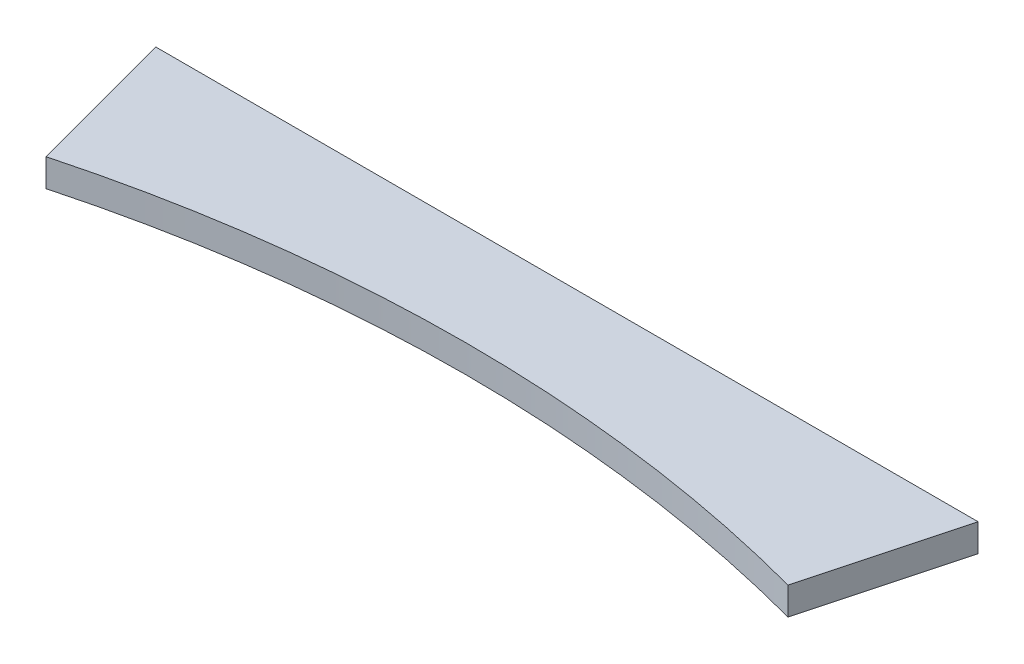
from build123d import *

# Parameters (mm, degrees)
BOSS_EXTRU_1_DEPTH = 15


with BuildPart() as part:
    # Esquisse1 → Boss.-Extru.1 (new body)
    with BuildSketch(Plane(origin=(0, 0, 0), x_dir=(1, 0, 0), z_dir=(0, 1, 0))):
        with BuildLine():
            Line((222.5, 0), (-222.5, 0))
            Line((-222.5, 0), (-200.771684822, -81.122298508))
            ThreePointArc((-200.771684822, -81.122298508), (0, -54.7), (200.771684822, -81.122298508))
            Line((200.771684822, -81.122298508), (222.5, 0))
        make_face()
    extrude(amount=BOSS_EXTRU_1_DEPTH)


solid = part.part
